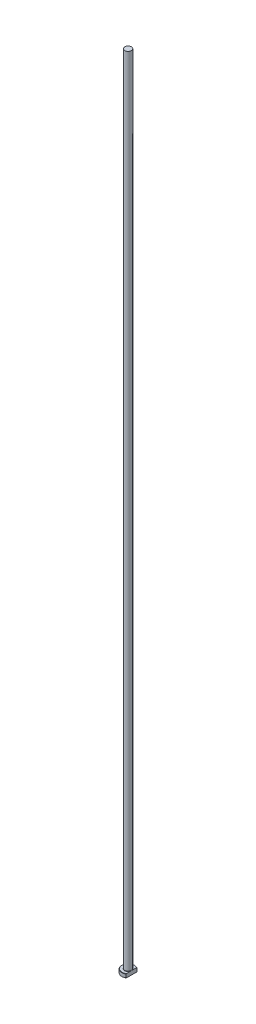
from build123d import *
from build123d.topology import SkipClean

# Parameters (mm, degrees)
CHAMFER1_SIZE = 0.2
FILLET1_R     = 0.2
KEY_DEPTH     = 631.03968129


with BuildPart() as part:
    # Sketch1 → Revolve1 (revolve)
    with BuildSketch(Plane.XY, mode=Mode.PRIVATE) as revolve1_sk:
        Polygon((0, 0), (-5, 0), (-5, 3), (-2.6, 3), (-2.6, 630), (0, 630), align=None)
    revolve(revolve1_sk.sketch.rotate(Axis((0, 259.958771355, 0), (0, -1, 0)), 270), axis=Axis((0, 259.958771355, 0), (0, -1, 0)))

    # Chamfer1
    chamfer1_edges = [part.edges().sort_by_distance(p)[0] for p in [
        (0, 3, -5),
        (0, 0, -5),
    ]]
    chamfer(chamfer1_edges, length=CHAMFER1_SIZE)

    # Fillet1
    fillet1_edges = [part.edges().sort_by_distance(p)[0] for p in [
        (0, 3, -2.6),
    ]]
    fillet(fillet1_edges, radius=FILLET1_R)

    # Sketch2 → KEY (cut, through all)
    with SkipClean():  # the faces are left unmerged after this step: merging them gives an invalid solid
        with BuildSketch(Plane(origin=(0, 0, 0), x_dir=(1, 0, 0), z_dir=(0, 1, 0))):
            with BuildLine():
                Line((2.6, 4.270831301), (2.6, -4.270831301))
                ThreePointArc((2.6, -4.270831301), (5, 0), (2.6, 4.270831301))
            make_face()
        extrude(amount=KEY_DEPTH, mode=Mode.SUBTRACT)


solid = part.part
